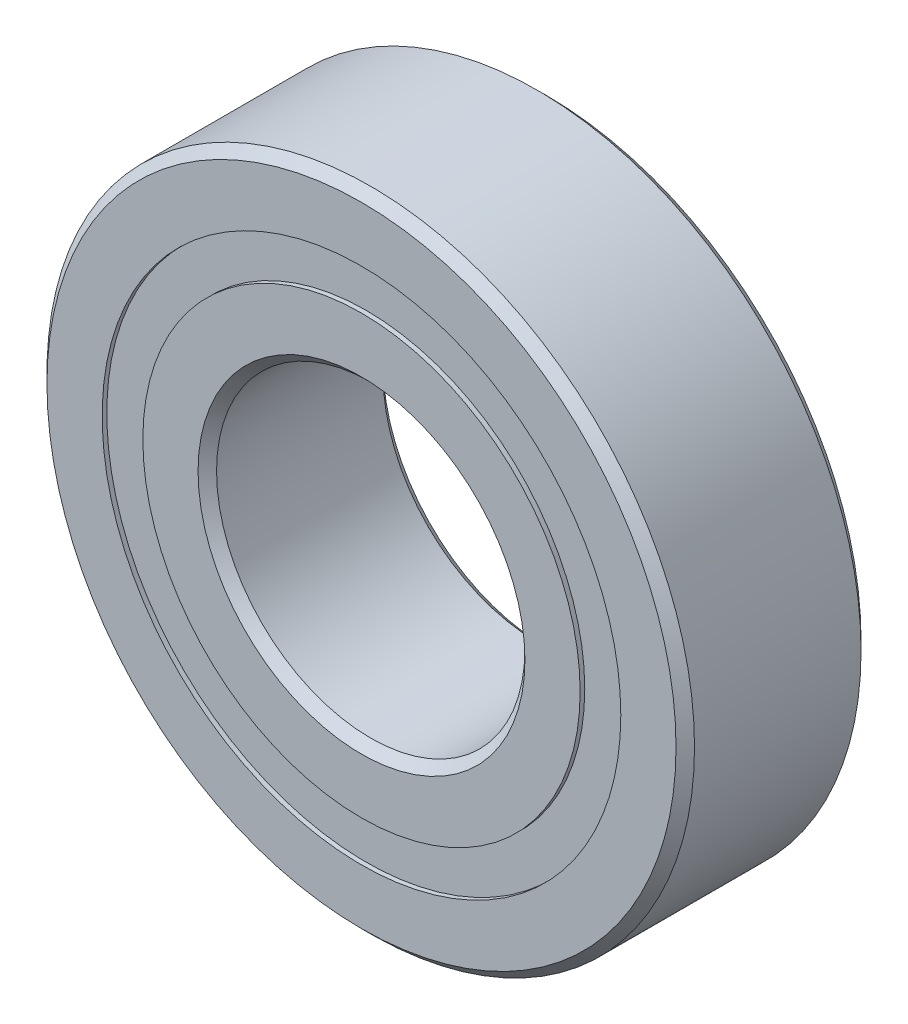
ISO-10303-21;
HEADER;
FILE_DESCRIPTION(('STEP AP214'),'2;1');
FILE_NAME('part.step','',(''),(''),'','','');
FILE_SCHEMA(('AUTOMOTIVE_DESIGN { 1 0 10303 214 1 1 1 1 }'));
ENDSEC;
DATA;
#1=APPLICATION_CONTEXT('core data for automotive mechanical design processes');
#2=APPLICATION_PROTOCOL_DEFINITION('international standard','automotive_design',2000,#1);
#3=PRODUCT_CONTEXT('',#1,'mechanical');
#4=PRODUCT('Part','Part','',(#3));
#5=PRODUCT_RELATED_PRODUCT_CATEGORY('part','',(#4));
#6=PRODUCT_DEFINITION_FORMATION('','',#4);
#7=PRODUCT_DEFINITION_CONTEXT('part definition',#1,'design');
#8=PRODUCT_DEFINITION('design','',#6,#7);
#9=PRODUCT_DEFINITION_SHAPE('','',#8);
#10=(LENGTH_UNIT() NAMED_UNIT(*) SI_UNIT(.MILLI.,.METRE.));
#11=(NAMED_UNIT(*) PLANE_ANGLE_UNIT() SI_UNIT($,.RADIAN.));
#12=(NAMED_UNIT(*) SI_UNIT($,.STERADIAN.) SOLID_ANGLE_UNIT());
#13=UNCERTAINTY_MEASURE_WITH_UNIT(LENGTH_MEASURE(1.E-05),#10,'distance_accuracy_value','');
#14=(GEOMETRIC_REPRESENTATION_CONTEXT(3) GLOBAL_UNCERTAINTY_ASSIGNED_CONTEXT((#13)) GLOBAL_UNIT_ASSIGNED_CONTEXT((#10,
#11,#12)) REPRESENTATION_CONTEXT('',''));
#15=CARTESIAN_POINT('',(0.,0.,0.));
#16=DIRECTION('',(0.,0.,1.));
#17=DIRECTION('',(1.,0.,0.));
#18=AXIS2_PLACEMENT_3D('',#15,#16,#17);
#19=CARTESIAN_POINT('',(0.,16.8186813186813,-5.70000000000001));
#20=DIRECTION('',(0.,0.,1.));
#21=DIRECTION('',(1.,0.,0.));
#22=AXIS2_PLACEMENT_3D('',#19,#20,#21);
#23=PLANE('',#22);
#24=CARTESIAN_POINT('',(0.,0.,-5.70000000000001));
#25=DIRECTION('',(0.,0.,1.));
#26=DIRECTION('',(1.,0.,0.));
#27=AXIS2_PLACEMENT_3D('',#24,#25,#26);
#28=CIRCLE('',#27,16.8186813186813);
#29=CARTESIAN_POINT('',(16.8186813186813,0.,-5.70000000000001));
#30=VERTEX_POINT('',#29);
#31=EDGE_CURVE('E55',#30,#30,#28,.T.);
#32=ORIENTED_EDGE('',*,*,#31,.F.);
#33=EDGE_LOOP('',(#32));
#34=FACE_BOUND('',#33,.T.);
#35=CARTESIAN_POINT('',(0.,0.,-5.70000000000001));
#36=DIRECTION('',(0.,0.,1.));
#37=DIRECTION('',(1.,0.,0.));
#38=AXIS2_PLACEMENT_3D('',#35,#36,#37);
#39=CIRCLE('',#38,14.1813186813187);
#40=CARTESIAN_POINT('',(14.1813186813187,0.,-5.70000000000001));
#41=VERTEX_POINT('',#40);
#42=EDGE_CURVE('E11',#41,#41,#39,.T.);
#43=ORIENTED_EDGE('',*,*,#42,.T.);
#44=EDGE_LOOP('',(#43));
#45=FACE_BOUND('',#44,.T.);
#46=ADVANCED_FACE('F41',(#34,#45),#23,.F.);
#47=CARTESIAN_POINT('',(0.,0.,6.));
#48=DIRECTION('',(0.,0.,1.));
#49=DIRECTION('',(1.,0.,0.));
#50=AXIS2_PLACEMENT_3D('',#47,#48,#49);
#51=CYLINDRICAL_SURFACE('',#50,14.1813186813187);
#52=ORIENTED_EDGE('',*,*,#42,.F.);
#53=EDGE_LOOP('',(#52));
#54=FACE_BOUND('',#53,.T.);
#55=CARTESIAN_POINT('',(0.,0.,-2.9749002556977));
#56=DIRECTION('',(0.,0.,1.));
#57=DIRECTION('',(1.,0.,0.));
#58=AXIS2_PLACEMENT_3D('',#55,#56,#57);
#59=CIRCLE('',#58,14.1813186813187);
#60=CARTESIAN_POINT('',(14.1813186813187,0.,-2.9749002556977));
#61=VERTEX_POINT('',#60);
#62=EDGE_CURVE('E47',#61,#61,#59,.T.);
#63=ORIENTED_EDGE('',*,*,#62,.T.);
#64=EDGE_LOOP('',(#63));
#65=FACE_BOUND('',#64,.T.);
#66=ADVANCED_FACE('F64',(#54,#65),#51,.F.);
#67=CARTESIAN_POINT('',(0.,16.8186813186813,-2.9749002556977));
#68=DIRECTION('',(0.,0.,-1.));
#69=DIRECTION('',(-1.,0.,0.));
#70=AXIS2_PLACEMENT_3D('',#67,#68,#69);
#71=PLANE('',#70);
#72=ORIENTED_EDGE('',*,*,#62,.F.);
#73=EDGE_LOOP('',(#72));
#74=FACE_BOUND('',#73,.T.);
#75=CARTESIAN_POINT('',(0.,0.,-2.9749002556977));
#76=DIRECTION('',(0.,0.,1.));
#77=DIRECTION('',(1.,0.,0.));
#78=AXIS2_PLACEMENT_3D('',#75,#76,#77);
#79=CIRCLE('',#78,16.8186813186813);
#80=CARTESIAN_POINT('',(16.8186813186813,0.,-2.9749002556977));
#81=VERTEX_POINT('',#80);
#82=EDGE_CURVE('E51',#81,#81,#79,.T.);
#83=ORIENTED_EDGE('',*,*,#82,.T.);
#84=EDGE_LOOP('',(#83));
#85=FACE_BOUND('',#84,.T.);
#86=ADVANCED_FACE('F68',(#74,#85),#71,.F.);
#87=CARTESIAN_POINT('',(0.,0.,6.));
#88=DIRECTION('',(0.,0.,1.));
#89=DIRECTION('',(1.,0.,0.));
#90=AXIS2_PLACEMENT_3D('',#87,#88,#89);
#91=CYLINDRICAL_SURFACE('',#90,16.8186813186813);
#92=ORIENTED_EDGE('',*,*,#82,.F.);
#93=EDGE_LOOP('',(#92));
#94=FACE_BOUND('',#93,.T.);
#95=ORIENTED_EDGE('',*,*,#31,.T.);
#96=EDGE_LOOP('',(#95));
#97=FACE_BOUND('',#96,.T.);
#98=ADVANCED_FACE('F61',(#94,#97),#91,.T.);
#99=CLOSED_SHELL('',(#46,#66,#86,#98));
#100=MANIFOLD_SOLID_BREP('B2',#99);
#101=CARTESIAN_POINT('',(0.,16.8186813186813,5.70000000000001));
#102=DIRECTION('',(0.,0.,-1.));
#103=DIRECTION('',(-1.,0.,0.));
#104=AXIS2_PLACEMENT_3D('',#101,#102,#103);
#105=PLANE('',#104);
#106=CARTESIAN_POINT('',(0.,0.,5.70000000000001));
#107=DIRECTION('',(0.,0.,1.));
#108=DIRECTION('',(1.,0.,0.));
#109=AXIS2_PLACEMENT_3D('',#106,#107,#108);
#110=CIRCLE('',#109,14.1813186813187);
#111=CARTESIAN_POINT('',(14.1813186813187,0.,5.70000000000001));
#112=VERTEX_POINT('',#111);
#113=EDGE_CURVE('E40',#112,#112,#110,.T.);
#114=ORIENTED_EDGE('',*,*,#113,.F.);
#115=EDGE_LOOP('',(#114));
#116=FACE_BOUND('',#115,.T.);
#117=CARTESIAN_POINT('',(0.,0.,5.70000000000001));
#118=DIRECTION('',(0.,0.,1.));
#119=DIRECTION('',(1.,0.,0.));
#120=AXIS2_PLACEMENT_3D('',#117,#118,#119);
#121=CIRCLE('',#120,16.8186813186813);
#122=CARTESIAN_POINT('',(16.8186813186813,0.,5.70000000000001));
#123=VERTEX_POINT('',#122);
#124=EDGE_CURVE('E122',#123,#123,#121,.T.);
#125=ORIENTED_EDGE('',*,*,#124,.T.);
#126=EDGE_LOOP('',(#125));
#127=FACE_BOUND('',#126,.T.);
#128=ADVANCED_FACE('F108',(#116,#127),#105,.F.);
#129=CARTESIAN_POINT('',(0.,0.,6.));
#130=DIRECTION('',(0.,0.,1.));
#131=DIRECTION('',(1.,0.,0.));
#132=AXIS2_PLACEMENT_3D('',#129,#130,#131);
#133=CYLINDRICAL_SURFACE('',#132,14.1813186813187);
#134=CARTESIAN_POINT('',(0.,0.,2.97490025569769));
#135=DIRECTION('',(0.,0.,1.));
#136=DIRECTION('',(1.,0.,0.));
#137=AXIS2_PLACEMENT_3D('',#134,#135,#136);
#138=CIRCLE('',#137,14.1813186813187);
#139=CARTESIAN_POINT('',(14.1813186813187,0.,2.97490025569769));
#140=VERTEX_POINT('',#139);
#141=EDGE_CURVE('E114',#140,#140,#138,.T.);
#142=ORIENTED_EDGE('',*,*,#141,.F.);
#143=EDGE_LOOP('',(#142));
#144=FACE_BOUND('',#143,.T.);
#145=ORIENTED_EDGE('',*,*,#113,.T.);
#146=EDGE_LOOP('',(#145));
#147=FACE_BOUND('',#146,.T.);
#148=ADVANCED_FACE('F137',(#144,#147),#133,.F.);
#149=CARTESIAN_POINT('',(0.,16.8186813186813,2.97490025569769));
#150=DIRECTION('',(0.,0.,1.));
#151=DIRECTION('',(1.,0.,0.));
#152=AXIS2_PLACEMENT_3D('',#149,#150,#151);
#153=PLANE('',#152);
#154=CARTESIAN_POINT('',(0.,0.,2.97490025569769));
#155=DIRECTION('',(0.,0.,1.));
#156=DIRECTION('',(1.,0.,0.));
#157=AXIS2_PLACEMENT_3D('',#154,#155,#156);
#158=CIRCLE('',#157,16.8186813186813);
#159=CARTESIAN_POINT('',(16.8186813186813,0.,2.97490025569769));
#160=VERTEX_POINT('',#159);
#161=EDGE_CURVE('E118',#160,#160,#158,.T.);
#162=ORIENTED_EDGE('',*,*,#161,.F.);
#163=EDGE_LOOP('',(#162));
#164=FACE_BOUND('',#163,.T.);
#165=ORIENTED_EDGE('',*,*,#141,.T.);
#166=EDGE_LOOP('',(#165));
#167=FACE_BOUND('',#166,.T.);
#168=ADVANCED_FACE('F132',(#164,#167),#153,.F.);
#169=CARTESIAN_POINT('',(0.,0.,6.));
#170=DIRECTION('',(0.,0.,1.));
#171=DIRECTION('',(1.,0.,0.));
#172=AXIS2_PLACEMENT_3D('',#169,#170,#171);
#173=CYLINDRICAL_SURFACE('',#172,16.8186813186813);
#174=ORIENTED_EDGE('',*,*,#124,.F.);
#175=EDGE_LOOP('',(#174));
#176=FACE_BOUND('',#175,.T.);
#177=ORIENTED_EDGE('',*,*,#161,.T.);
#178=EDGE_LOOP('',(#177));
#179=FACE_BOUND('',#178,.T.);
#180=ADVANCED_FACE('F129',(#176,#179),#173,.T.);
#181=CLOSED_SHELL('',(#128,#148,#168,#180));
#182=MANIFOLD_SOLID_BREP('B6',#181);
#183=CARTESIAN_POINT('',(-6.72519795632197,13.9650174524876,0.));
#184=DIRECTION('',(0.,0.,1.));
#185=DIRECTION('',(-0.433883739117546,0.900968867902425,0.));
#186=AXIS2_PLACEMENT_3D('',#183,#184,#185);
#187=SPHERICAL_SURFACE('',#186,2.97490025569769);
#188=CARTESIAN_POINT('',(-6.72519795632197,13.9650174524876,2.97490025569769));
#189=VERTEX_POINT('',#188);
#190=VERTEX_LOOP('',#189);
#191=FACE_BOUND('',#190,.T.);
#192=ADVANCED_FACE('F175',(#191),#187,.T.);
#193=CLOSED_SHELL('',(#192));
#194=MANIFOLD_SOLID_BREP('B35',#193);
#195=CARTESIAN_POINT('',(-12.1183879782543,9.66409192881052,0.));
#196=DIRECTION('',(0.,0.,1.));
#197=DIRECTION('',(-0.781831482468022,0.623489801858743,0.));
#198=AXIS2_PLACEMENT_3D('',#195,#196,#197);
#199=SPHERICAL_SURFACE('',#198,2.97490025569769);
#200=CARTESIAN_POINT('',(-12.1183879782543,9.66409192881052,2.97490025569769));
#201=VERTEX_POINT('',#200);
#202=VERTEX_LOOP('',#201);
#203=FACE_BOUND('',#202,.T.);
#204=ADVANCED_FACE('F195',(#203),#199,.T.);
#205=CLOSED_SHELL('',(#204));
#206=MANIFOLD_SOLID_BREP('B104',#205);
#207=CARTESIAN_POINT('',(-15.1113826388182,3.44907447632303,0.));
#208=DIRECTION('',(0.,0.,1.));
#209=DIRECTION('',(-0.974927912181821,0.222520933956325,0.));
#210=AXIS2_PLACEMENT_3D('',#207,#208,#209);
#211=SPHERICAL_SURFACE('',#210,2.97490025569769);
#212=CARTESIAN_POINT('',(-15.1113826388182,3.44907447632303,2.97490025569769));
#213=VERTEX_POINT('',#212);
#214=VERTEX_LOOP('',#213);
#215=FACE_BOUND('',#214,.T.);
#216=ADVANCED_FACE('F215',(#215),#211,.T.);
#217=CLOSED_SHELL('',(#216));
#218=MANIFOLD_SOLID_BREP('B171',#217);
#219=CARTESIAN_POINT('',(-15.1113826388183,-3.44907447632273,0.));
#220=DIRECTION('',(0.,0.,1.));
#221=DIRECTION('',(-0.974927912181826,-0.222520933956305,0.));
#222=AXIS2_PLACEMENT_3D('',#219,#220,#221);
#223=SPHERICAL_SURFACE('',#222,2.97490025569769);
#224=CARTESIAN_POINT('',(-15.1113826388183,-3.44907447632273,2.97490025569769));
#225=VERTEX_POINT('',#224);
#226=VERTEX_LOOP('',#225);
#227=FACE_BOUND('',#226,.T.);
#228=ADVANCED_FACE('F235',(#227),#223,.T.);
#229=CLOSED_SHELL('',(#228));
#230=MANIFOLD_SOLID_BREP('B191',#229);
#231=CARTESIAN_POINT('',(-12.1183879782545,-9.66409192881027,0.));
#232=DIRECTION('',(0.,0.,1.));
#233=DIRECTION('',(-0.781831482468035,-0.623489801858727,0.));
#234=AXIS2_PLACEMENT_3D('',#231,#232,#233);
#235=SPHERICAL_SURFACE('',#234,2.97490025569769);
#236=CARTESIAN_POINT('',(-12.1183879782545,-9.66409192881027,2.97490025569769));
#237=VERTEX_POINT('',#236);
#238=VERTEX_LOOP('',#237);
#239=FACE_BOUND('',#238,.T.);
#240=ADVANCED_FACE('F255',(#239),#235,.T.);
#241=CLOSED_SHELL('',(#240));
#242=MANIFOLD_SOLID_BREP('B211',#241);
#243=CARTESIAN_POINT('',(-6.72519795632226,-13.9650174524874,0.));
#244=DIRECTION('',(0.,0.,1.));
#245=DIRECTION('',(-0.433883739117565,-0.900968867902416,0.));
#246=AXIS2_PLACEMENT_3D('',#243,#244,#245);
#247=SPHERICAL_SURFACE('',#246,2.97490025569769);
#248=CARTESIAN_POINT('',(-6.72519795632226,-13.9650174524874,2.97490025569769));
#249=VERTEX_POINT('',#248);
#250=VERTEX_LOOP('',#249);
#251=FACE_BOUND('',#250,.T.);
#252=ADVANCED_FACE('F275',(#251),#247,.T.);
#253=CLOSED_SHELL('',(#252));
#254=MANIFOLD_SOLID_BREP('B231',#253);
#255=CARTESIAN_POINT('',(-1.08235984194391E-13,-15.5,0.));
#256=DIRECTION('',(0.,0.,1.));
#257=DIRECTION('',(0.,-1.,0.));
#258=AXIS2_PLACEMENT_3D('',#255,#256,#257);
#259=SPHERICAL_SURFACE('',#258,2.97490025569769);
#260=CARTESIAN_POINT('',(-1.08235984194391E-13,-15.5,2.97490025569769));
#261=VERTEX_POINT('',#260);
#262=VERTEX_LOOP('',#261);
#263=FACE_BOUND('',#262,.T.);
#264=ADVANCED_FACE('F295',(#263),#259,.T.);
#265=CLOSED_SHELL('',(#264));
#266=MANIFOLD_SOLID_BREP('B251',#265);
#267=CARTESIAN_POINT('',(6.72519795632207,-13.9650174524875,0.));
#268=DIRECTION('',(0.,0.,1.));
#269=DIRECTION('',(0.433883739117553,-0.900968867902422,0.));
#270=AXIS2_PLACEMENT_3D('',#267,#268,#269);
#271=SPHERICAL_SURFACE('',#270,2.97490025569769);
#272=CARTESIAN_POINT('',(6.72519795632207,-13.9650174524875,2.97490025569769));
#273=VERTEX_POINT('',#272);
#274=VERTEX_LOOP('',#273);
#275=FACE_BOUND('',#274,.T.);
#276=ADVANCED_FACE('F315',(#275),#271,.T.);
#277=CLOSED_SHELL('',(#276));
#278=MANIFOLD_SOLID_BREP('B271',#277);
#279=CARTESIAN_POINT('',(12.1183879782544,-9.66409192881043,0.));
#280=DIRECTION('',(0.,0.,1.));
#281=DIRECTION('',(0.781831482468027,-0.623489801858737,0.));
#282=AXIS2_PLACEMENT_3D('',#279,#280,#281);
#283=SPHERICAL_SURFACE('',#282,2.97490025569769);
#284=CARTESIAN_POINT('',(12.1183879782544,-9.66409192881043,2.97490025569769));
#285=VERTEX_POINT('',#284);
#286=VERTEX_LOOP('',#285);
#287=FACE_BOUND('',#286,.T.);
#288=ADVANCED_FACE('F335',(#287),#283,.T.);
#289=CLOSED_SHELL('',(#288));
#290=MANIFOLD_SOLID_BREP('B291',#289);
#291=CARTESIAN_POINT('',(15.1113826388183,-3.44907447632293,0.));
#292=DIRECTION('',(0.,0.,1.));
#293=DIRECTION('',(0.974927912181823,-0.222520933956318,0.));
#294=AXIS2_PLACEMENT_3D('',#291,#292,#293);
#295=SPHERICAL_SURFACE('',#294,2.97490025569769);
#296=CARTESIAN_POINT('',(15.1113826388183,-3.44907447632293,2.97490025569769));
#297=VERTEX_POINT('',#296);
#298=VERTEX_LOOP('',#297);
#299=FACE_BOUND('',#298,.T.);
#300=ADVANCED_FACE('F355',(#299),#295,.T.);
#301=CLOSED_SHELL('',(#300));
#302=MANIFOLD_SOLID_BREP('B311',#301);
#303=CARTESIAN_POINT('',(15.1113826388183,3.44907447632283,0.));
#304=DIRECTION('',(0.,0.,1.));
#305=DIRECTION('',(0.974927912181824,0.222520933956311,0.));
#306=AXIS2_PLACEMENT_3D('',#303,#304,#305);
#307=SPHERICAL_SURFACE('',#306,2.97490025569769);
#308=CARTESIAN_POINT('',(15.1113826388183,3.44907447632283,2.97490025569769));
#309=VERTEX_POINT('',#308);
#310=VERTEX_LOOP('',#309);
#311=FACE_BOUND('',#310,.T.);
#312=ADVANCED_FACE('F375',(#311),#307,.T.);
#313=CLOSED_SHELL('',(#312));
#314=MANIFOLD_SOLID_BREP('B331',#313);
#315=CARTESIAN_POINT('',(12.1183879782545,9.66409192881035,0.));
#316=DIRECTION('',(0.,0.,1.));
#317=DIRECTION('',(0.781831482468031,0.623489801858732,0.));
#318=AXIS2_PLACEMENT_3D('',#315,#316,#317);
#319=SPHERICAL_SURFACE('',#318,2.97490025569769);
#320=CARTESIAN_POINT('',(12.1183879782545,9.66409192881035,2.97490025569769));
#321=VERTEX_POINT('',#320);
#322=VERTEX_LOOP('',#321);
#323=FACE_BOUND('',#322,.T.);
#324=ADVANCED_FACE('F395',(#323),#319,.T.);
#325=CLOSED_SHELL('',(#324));
#326=MANIFOLD_SOLID_BREP('B351',#325);
#327=CARTESIAN_POINT('',(6.72519795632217,13.9650174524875,0.));
#328=DIRECTION('',(0.,0.,1.));
#329=DIRECTION('',(0.433883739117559,0.900968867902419,0.));
#330=AXIS2_PLACEMENT_3D('',#327,#328,#329);
#331=SPHERICAL_SURFACE('',#330,2.97490025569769);
#332=CARTESIAN_POINT('',(6.72519795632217,13.9650174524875,2.97490025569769));
#333=VERTEX_POINT('',#332);
#334=VERTEX_LOOP('',#333);
#335=FACE_BOUND('',#334,.T.);
#336=ADVANCED_FACE('F415',(#335),#331,.T.);
#337=CLOSED_SHELL('',(#336));
#338=MANIFOLD_SOLID_BREP('B371',#337);
#339=CARTESIAN_POINT('',(0.,15.5,0.));
#340=DIRECTION('',(0.,0.,1.));
#341=DIRECTION('',(0.,1.,0.));
#342=AXIS2_PLACEMENT_3D('',#339,#340,#341);
#343=SPHERICAL_SURFACE('',#342,2.97490025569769);
#344=CARTESIAN_POINT('',(0.,15.5,2.97490025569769));
#345=VERTEX_POINT('',#344);
#346=VERTEX_LOOP('',#345);
#347=FACE_BOUND('',#346,.T.);
#348=ADVANCED_FACE('F437',(#347),#343,.T.);
#349=CLOSED_SHELL('',(#348));
#350=MANIFOLD_SOLID_BREP('B391',#349);
#351=CARTESIAN_POINT('',(0.,14.1813186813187,6.00000000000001));
#352=DIRECTION('',(0.,0.,-1.));
#353=DIRECTION('',(-1.,0.,0.));
#354=AXIS2_PLACEMENT_3D('',#351,#352,#353);
#355=PLANE('',#354);
#356=CARTESIAN_POINT('',(0.,0.,6.00000000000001));
#357=DIRECTION('',(0.,0.,1.));
#358=DIRECTION('',(1.,0.,0.));
#359=AXIS2_PLACEMENT_3D('',#356,#357,#358);
#360=CIRCLE('',#359,10.6);
#361=CARTESIAN_POINT('',(10.6,0.,6.00000000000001));
#362=VERTEX_POINT('',#361);
#363=EDGE_CURVE('E484',#362,#362,#360,.T.);
#364=ORIENTED_EDGE('',*,*,#363,.F.);
#365=EDGE_LOOP('',(#364));
#366=FACE_BOUND('',#365,.T.);
#367=CARTESIAN_POINT('',(0.,0.,6.00000000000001));
#368=DIRECTION('',(0.,0.,1.));
#369=DIRECTION('',(1.,0.,0.));
#370=AXIS2_PLACEMENT_3D('',#367,#368,#369);
#371=CIRCLE('',#370,14.1813186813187);
#372=CARTESIAN_POINT('',(14.1813186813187,0.,6.00000000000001));
#373=VERTEX_POINT('',#372);
#374=EDGE_CURVE('E436',#373,#373,#371,.T.);
#375=ORIENTED_EDGE('',*,*,#374,.T.);
#376=EDGE_LOOP('',(#375));
#377=FACE_BOUND('',#376,.T.);
#378=ADVANCED_FACE('F456',(#366,#377),#355,.F.);
#379=CARTESIAN_POINT('',(0.,0.,6.));
#380=DIRECTION('',(0.,0.,1.));
#381=DIRECTION('',(1.,0.,0.));
#382=AXIS2_PLACEMENT_3D('',#379,#380,#381);
#383=CYLINDRICAL_SURFACE('',#382,14.1813186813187);
#384=ORIENTED_EDGE('',*,*,#374,.F.);
#385=EDGE_LOOP('',(#384));
#386=FACE_BOUND('',#385,.T.);
#387=CARTESIAN_POINT('',(0.,0.,2.66666666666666));
#388=DIRECTION('',(0.,0.,1.));
#389=DIRECTION('',(1.,0.,0.));
#390=AXIS2_PLACEMENT_3D('',#387,#388,#389);
#391=CIRCLE('',#390,14.1813186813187);
#392=CARTESIAN_POINT('',(14.1813186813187,0.,2.66666666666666));
#393=VERTEX_POINT('',#392);
#394=EDGE_CURVE('E462',#393,#393,#391,.T.);
#395=ORIENTED_EDGE('',*,*,#394,.T.);
#396=EDGE_LOOP('',(#395));
#397=FACE_BOUND('',#396,.T.);
#398=ADVANCED_FACE('F491',(#386,#397),#383,.T.);
#399=CARTESIAN_POINT('',(0.,0.,0.));
#400=DIRECTION('',(0.,0.,1.));
#401=DIRECTION('',(1.,0.,0.));
#402=AXIS2_PLACEMENT_3D('',#399,#400,#401);
#403=TOROIDAL_SURFACE('',#402,15.5,2.97490025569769);
#404=ORIENTED_EDGE('',*,*,#394,.F.);
#405=EDGE_LOOP('',(#404));
#406=FACE_BOUND('',#405,.T.);
#407=CARTESIAN_POINT('',(0.,0.,-2.66666666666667));
#408=DIRECTION('',(0.,0.,1.));
#409=DIRECTION('',(1.,0.,0.));
#410=AXIS2_PLACEMENT_3D('',#407,#408,#409);
#411=CIRCLE('',#410,14.1813186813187);
#412=CARTESIAN_POINT('',(14.1813186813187,0.,-2.66666666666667));
#413=VERTEX_POINT('',#412);
#414=EDGE_CURVE('E466',#413,#413,#411,.T.);
#415=ORIENTED_EDGE('',*,*,#414,.T.);
#416=EDGE_LOOP('',(#415));
#417=FACE_BOUND('',#416,.T.);
#418=ADVANCED_FACE('F495',(#406,#417),#403,.F.);
#419=CARTESIAN_POINT('',(0.,0.,6.));
#420=DIRECTION('',(0.,0.,1.));
#421=DIRECTION('',(1.,0.,0.));
#422=AXIS2_PLACEMENT_3D('',#419,#420,#421);
#423=CYLINDRICAL_SURFACE('',#422,14.1813186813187);
#424=ORIENTED_EDGE('',*,*,#414,.F.);
#425=EDGE_LOOP('',(#424));
#426=FACE_BOUND('',#425,.T.);
#427=CARTESIAN_POINT('',(0.,0.,-6.00000000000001));
#428=DIRECTION('',(0.,0.,1.));
#429=DIRECTION('',(1.,0.,0.));
#430=AXIS2_PLACEMENT_3D('',#427,#428,#429);
#431=CIRCLE('',#430,14.1813186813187);
#432=CARTESIAN_POINT('',(14.1813186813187,0.,-6.00000000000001));
#433=VERTEX_POINT('',#432);
#434=EDGE_CURVE('E470',#433,#433,#431,.T.);
#435=ORIENTED_EDGE('',*,*,#434,.T.);
#436=EDGE_LOOP('',(#435));
#437=FACE_BOUND('',#436,.T.);
#438=ADVANCED_FACE('F500',(#426,#437),#423,.T.);
#439=CARTESIAN_POINT('',(0.,10.6,-6.00000000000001));
#440=DIRECTION('',(0.,0.,1.));
#441=DIRECTION('',(1.,0.,0.));
#442=AXIS2_PLACEMENT_3D('',#439,#440,#441);
#443=PLANE('',#442);
#444=ORIENTED_EDGE('',*,*,#434,.F.);
#445=EDGE_LOOP('',(#444));
#446=FACE_BOUND('',#445,.T.);
#447=CARTESIAN_POINT('',(0.,0.,-6.00000000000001));
#448=DIRECTION('',(0.,0.,1.));
#449=DIRECTION('',(1.,0.,0.));
#450=AXIS2_PLACEMENT_3D('',#447,#448,#449);
#451=CIRCLE('',#450,10.6);
#452=CARTESIAN_POINT('',(10.6,0.,-6.00000000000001));
#453=VERTEX_POINT('',#452);
#454=EDGE_CURVE('E475',#453,#453,#451,.T.);
#455=ORIENTED_EDGE('',*,*,#454,.T.);
#456=EDGE_LOOP('',(#455));
#457=FACE_BOUND('',#456,.T.);
#458=ADVANCED_FACE('F506',(#446,#457),#443,.F.);
#459=CARTESIAN_POINT('',(0.,0.,-5.40000000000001));
#460=DIRECTION('',(0.,0.,-1.));
#461=DIRECTION('',(-1.,0.,0.));
#462=AXIS2_PLACEMENT_3D('',#459,#460,#461);
#463=CONICAL_SURFACE('',#462,10.,0.785398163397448);
#464=ORIENTED_EDGE('',*,*,#454,.F.);
#465=EDGE_LOOP('',(#464));
#466=FACE_BOUND('',#465,.T.);
#467=CARTESIAN_POINT('',(0.,0.,-5.40000000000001));
#468=DIRECTION('',(0.,0.,1.));
#469=DIRECTION('',(1.,0.,0.));
#470=AXIS2_PLACEMENT_3D('',#467,#468,#469);
#471=CIRCLE('',#470,10.);
#472=CARTESIAN_POINT('',(10.,0.,-5.40000000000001));
#473=VERTEX_POINT('',#472);
#474=EDGE_CURVE('E478',#473,#473,#471,.T.);
#475=ORIENTED_EDGE('',*,*,#474,.T.);
#476=EDGE_LOOP('',(#475));
#477=FACE_BOUND('',#476,.T.);
#478=ADVANCED_FACE('F510',(#466,#477),#463,.F.);
#479=CARTESIAN_POINT('',(0.,0.,6.));
#480=DIRECTION('',(0.,0.,1.));
#481=DIRECTION('',(1.,0.,0.));
#482=AXIS2_PLACEMENT_3D('',#479,#480,#481);
#483=CYLINDRICAL_SURFACE('',#482,10.);
#484=ORIENTED_EDGE('',*,*,#474,.F.);
#485=EDGE_LOOP('',(#484));
#486=FACE_BOUND('',#485,.T.);
#487=CARTESIAN_POINT('',(0.,0.,5.40000000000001));
#488=DIRECTION('',(0.,0.,1.));
#489=DIRECTION('',(1.,0.,0.));
#490=AXIS2_PLACEMENT_3D('',#487,#488,#489);
#491=CIRCLE('',#490,10.);
#492=CARTESIAN_POINT('',(10.,0.,5.40000000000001));
#493=VERTEX_POINT('',#492);
#494=EDGE_CURVE('E481',#493,#493,#491,.T.);
#495=ORIENTED_EDGE('',*,*,#494,.T.);
#496=EDGE_LOOP('',(#495));
#497=FACE_BOUND('',#496,.T.);
#498=ADVANCED_FACE('F514',(#486,#497),#483,.F.);
#499=CARTESIAN_POINT('',(0.,0.,6.00000000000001));
#500=DIRECTION('',(0.,0.,1.));
#501=DIRECTION('',(1.,0.,0.));
#502=AXIS2_PLACEMENT_3D('',#499,#500,#501);
#503=CONICAL_SURFACE('',#502,10.6,0.785398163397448);
#504=ORIENTED_EDGE('',*,*,#494,.F.);
#505=EDGE_LOOP('',(#504));
#506=FACE_BOUND('',#505,.T.);
#507=ORIENTED_EDGE('',*,*,#363,.T.);
#508=EDGE_LOOP('',(#507));
#509=FACE_BOUND('',#508,.T.);
#510=ADVANCED_FACE('F488',(#506,#509),#503,.F.);
#511=CLOSED_SHELL('',(#378,#398,#418,#438,#458,#478,#498,#510));
#512=MANIFOLD_SOLID_BREP('B411',#511);
#513=CARTESIAN_POINT('',(0.,0.,5.4));
#514=DIRECTION('',(0.,0.,-1.));
#515=DIRECTION('',(-1.,0.,0.));
#516=AXIS2_PLACEMENT_3D('',#513,#514,#515);
#517=CONICAL_SURFACE('',#516,21.,0.785398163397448);
#518=CARTESIAN_POINT('',(0.,0.,6.));
#519=DIRECTION('',(0.,0.,1.));
#520=DIRECTION('',(1.,0.,0.));
#521=AXIS2_PLACEMENT_3D('',#518,#519,#520);
#522=CIRCLE('',#521,20.4);
#523=CARTESIAN_POINT('',(20.4,0.,6.));
#524=VERTEX_POINT('',#523);
#525=EDGE_CURVE('E605',#524,#524,#522,.T.);
#526=ORIENTED_EDGE('',*,*,#525,.F.);
#527=EDGE_LOOP('',(#526));
#528=FACE_BOUND('',#527,.T.);
#529=CARTESIAN_POINT('',(0.,0.,5.4));
#530=DIRECTION('',(0.,0.,1.));
#531=DIRECTION('',(1.,0.,0.));
#532=AXIS2_PLACEMENT_3D('',#529,#530,#531);
#533=CIRCLE('',#532,21.);
#534=CARTESIAN_POINT('',(21.,0.,5.4));
#535=VERTEX_POINT('',#534);
#536=EDGE_CURVE('E455',#535,#535,#533,.T.);
#537=ORIENTED_EDGE('',*,*,#536,.T.);
#538=EDGE_LOOP('',(#537));
#539=FACE_BOUND('',#538,.T.);
#540=ADVANCED_FACE('F577',(#528,#539),#517,.T.);
#541=CARTESIAN_POINT('',(0.,0.,6.));
#542=DIRECTION('',(0.,0.,1.));
#543=DIRECTION('',(1.,0.,0.));
#544=AXIS2_PLACEMENT_3D('',#541,#542,#543);
#545=CYLINDRICAL_SURFACE('',#544,21.);
#546=ORIENTED_EDGE('',*,*,#536,.F.);
#547=EDGE_LOOP('',(#546));
#548=FACE_BOUND('',#547,.T.);
#549=CARTESIAN_POINT('',(0.,0.,-5.40000000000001));
#550=DIRECTION('',(0.,0.,1.));
#551=DIRECTION('',(1.,0.,0.));
#552=AXIS2_PLACEMENT_3D('',#549,#550,#551);
#553=CIRCLE('',#552,21.);
#554=CARTESIAN_POINT('',(21.,0.,-5.40000000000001));
#555=VERTEX_POINT('',#554);
#556=EDGE_CURVE('E583',#555,#555,#553,.T.);
#557=ORIENTED_EDGE('',*,*,#556,.T.);
#558=EDGE_LOOP('',(#557));
#559=FACE_BOUND('',#558,.T.);
#560=ADVANCED_FACE('F612',(#548,#559),#545,.T.);
#561=CARTESIAN_POINT('',(0.,0.,-6.00000000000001));
#562=DIRECTION('',(0.,0.,1.));
#563=DIRECTION('',(1.,0.,0.));
#564=AXIS2_PLACEMENT_3D('',#561,#562,#563);
#565=CONICAL_SURFACE('',#564,20.4,0.785398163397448);
#566=ORIENTED_EDGE('',*,*,#556,.F.);
#567=EDGE_LOOP('',(#566));
#568=FACE_BOUND('',#567,.T.);
#569=CARTESIAN_POINT('',(0.,0.,-6.00000000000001));
#570=DIRECTION('',(0.,0.,1.));
#571=DIRECTION('',(1.,0.,0.));
#572=AXIS2_PLACEMENT_3D('',#569,#570,#571);
#573=CIRCLE('',#572,20.4);
#574=CARTESIAN_POINT('',(20.4,0.,-6.00000000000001));
#575=VERTEX_POINT('',#574);
#576=EDGE_CURVE('E587',#575,#575,#573,.T.);
#577=ORIENTED_EDGE('',*,*,#576,.T.);
#578=EDGE_LOOP('',(#577));
#579=FACE_BOUND('',#578,.T.);
#580=ADVANCED_FACE('F616',(#568,#579),#565,.T.);
#581=CARTESIAN_POINT('',(0.,20.4,-6.00000000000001));
#582=DIRECTION('',(0.,0.,1.));
#583=DIRECTION('',(1.,0.,0.));
#584=AXIS2_PLACEMENT_3D('',#581,#582,#583);
#585=PLANE('',#584);
#586=ORIENTED_EDGE('',*,*,#576,.F.);
#587=EDGE_LOOP('',(#586));
#588=FACE_BOUND('',#587,.T.);
#589=CARTESIAN_POINT('',(0.,0.,-6.00000000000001));
#590=DIRECTION('',(0.,0.,1.));
#591=DIRECTION('',(1.,0.,0.));
#592=AXIS2_PLACEMENT_3D('',#589,#590,#591);
#593=CIRCLE('',#592,16.8186813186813);
#594=CARTESIAN_POINT('',(16.8186813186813,0.,-6.00000000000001));
#595=VERTEX_POINT('',#594);
#596=EDGE_CURVE('E591',#595,#595,#593,.T.);
#597=ORIENTED_EDGE('',*,*,#596,.T.);
#598=EDGE_LOOP('',(#597));
#599=FACE_BOUND('',#598,.T.);
#600=ADVANCED_FACE('F621',(#588,#599),#585,.F.);
#601=CARTESIAN_POINT('',(0.,0.,6.));
#602=DIRECTION('',(0.,0.,1.));
#603=DIRECTION('',(1.,0.,0.));
#604=AXIS2_PLACEMENT_3D('',#601,#602,#603);
#605=CYLINDRICAL_SURFACE('',#604,16.8186813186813);
#606=ORIENTED_EDGE('',*,*,#596,.F.);
#607=EDGE_LOOP('',(#606));
#608=FACE_BOUND('',#607,.T.);
#609=CARTESIAN_POINT('',(0.,0.,-2.66666666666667));
#610=DIRECTION('',(0.,0.,1.));
#611=DIRECTION('',(1.,0.,0.));
#612=AXIS2_PLACEMENT_3D('',#609,#610,#611);
#613=CIRCLE('',#612,16.8186813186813);
#614=CARTESIAN_POINT('',(16.8186813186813,0.,-2.66666666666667));
#615=VERTEX_POINT('',#614);
#616=EDGE_CURVE('E596',#615,#615,#613,.T.);
#617=ORIENTED_EDGE('',*,*,#616,.T.);
#618=EDGE_LOOP('',(#617));
#619=FACE_BOUND('',#618,.T.);
#620=ADVANCED_FACE('F627',(#608,#619),#605,.F.);
#621=CARTESIAN_POINT('',(0.,0.,0.));
#622=DIRECTION('',(0.,0.,1.));
#623=DIRECTION('',(1.,0.,0.));
#624=AXIS2_PLACEMENT_3D('',#621,#622,#623);
#625=TOROIDAL_SURFACE('',#624,15.5,2.97490025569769);
#626=ORIENTED_EDGE('',*,*,#616,.F.);
#627=EDGE_LOOP('',(#626));
#628=FACE_BOUND('',#627,.T.);
#629=CARTESIAN_POINT('',(0.,0.,2.66666666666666));
#630=DIRECTION('',(0.,0.,1.));
#631=DIRECTION('',(1.,0.,0.));
#632=AXIS2_PLACEMENT_3D('',#629,#630,#631);
#633=CIRCLE('',#632,16.8186813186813);
#634=CARTESIAN_POINT('',(16.8186813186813,0.,2.66666666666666));
#635=VERTEX_POINT('',#634);
#636=EDGE_CURVE('E599',#635,#635,#633,.T.);
#637=ORIENTED_EDGE('',*,*,#636,.T.);
#638=EDGE_LOOP('',(#637));
#639=FACE_BOUND('',#638,.T.);
#640=ADVANCED_FACE('F631',(#628,#639),#625,.F.);
#641=CARTESIAN_POINT('',(0.,0.,6.));
#642=DIRECTION('',(0.,0.,1.));
#643=DIRECTION('',(1.,0.,0.));
#644=AXIS2_PLACEMENT_3D('',#641,#642,#643);
#645=CYLINDRICAL_SURFACE('',#644,16.8186813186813);
#646=ORIENTED_EDGE('',*,*,#636,.F.);
#647=EDGE_LOOP('',(#646));
#648=FACE_BOUND('',#647,.T.);
#649=CARTESIAN_POINT('',(0.,0.,6.));
#650=DIRECTION('',(0.,0.,1.));
#651=DIRECTION('',(1.,0.,0.));
#652=AXIS2_PLACEMENT_3D('',#649,#650,#651);
#653=CIRCLE('',#652,16.8186813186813);
#654=CARTESIAN_POINT('',(16.8186813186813,0.,6.));
#655=VERTEX_POINT('',#654);
#656=EDGE_CURVE('E602',#655,#655,#653,.T.);
#657=ORIENTED_EDGE('',*,*,#656,.T.);
#658=EDGE_LOOP('',(#657));
#659=FACE_BOUND('',#658,.T.);
#660=ADVANCED_FACE('F635',(#648,#659),#645,.F.);
#661=CARTESIAN_POINT('',(0.,20.4,6.));
#662=DIRECTION('',(0.,0.,-1.));
#663=DIRECTION('',(-1.,0.,0.));
#664=AXIS2_PLACEMENT_3D('',#661,#662,#663);
#665=PLANE('',#664);
#666=ORIENTED_EDGE('',*,*,#656,.F.);
#667=EDGE_LOOP('',(#666));
#668=FACE_BOUND('',#667,.T.);
#669=ORIENTED_EDGE('',*,*,#525,.T.);
#670=EDGE_LOOP('',(#669));
#671=FACE_BOUND('',#670,.T.);
#672=ADVANCED_FACE('F609',(#668,#671),#665,.F.);
#673=CLOSED_SHELL('',(#540,#560,#580,#600,#620,#640,#660,#672));
#674=MANIFOLD_SOLID_BREP('B431',#673);
#675=ADVANCED_BREP_SHAPE_REPRESENTATION('',(#18,#100,#182,#194,#206,#218,#230,#242,#254,#266,
#278,#290,#302,#314,#326,#338,#350,#512,#674),#14);
#676=SHAPE_DEFINITION_REPRESENTATION(#9,#675);
ENDSEC;
END-ISO-10303-21;
